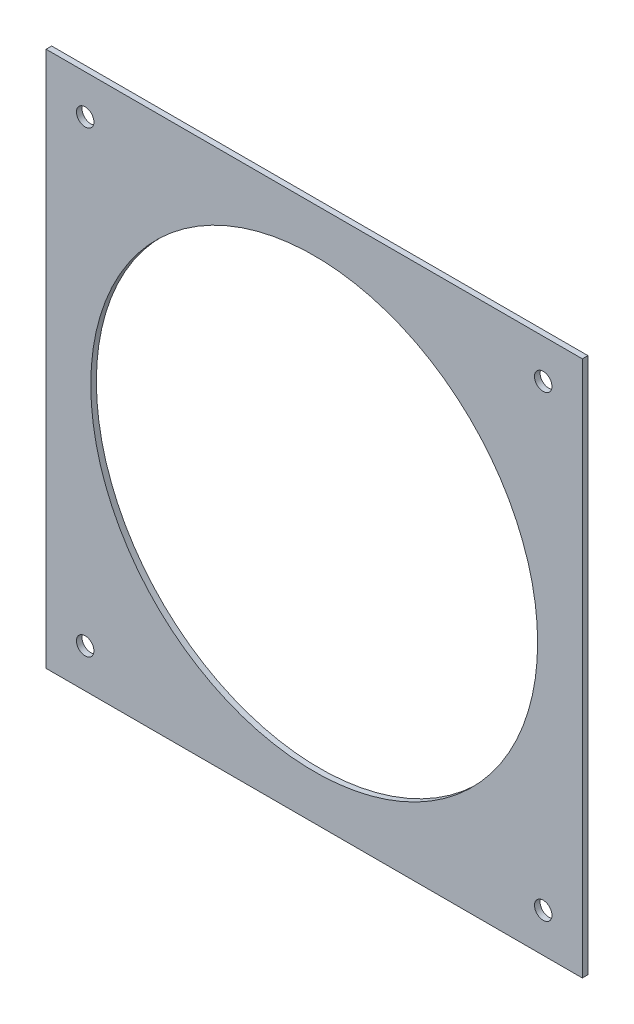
ISO-10303-21;
HEADER;
FILE_DESCRIPTION(('STEP AP214'),'2;1');
FILE_NAME('part.step','',(''),(''),'','','');
FILE_SCHEMA(('AUTOMOTIVE_DESIGN { 1 0 10303 214 1 1 1 1 }'));
ENDSEC;
DATA;
#1=APPLICATION_CONTEXT('core data for automotive mechanical design processes');
#2=APPLICATION_PROTOCOL_DEFINITION('international standard','automotive_design',2000,#1);
#3=PRODUCT_CONTEXT('',#1,'mechanical');
#4=PRODUCT('Part','Part','',(#3));
#5=PRODUCT_RELATED_PRODUCT_CATEGORY('part','',(#4));
#6=PRODUCT_DEFINITION_FORMATION('','',#4);
#7=PRODUCT_DEFINITION_CONTEXT('part definition',#1,'design');
#8=PRODUCT_DEFINITION('design','',#6,#7);
#9=PRODUCT_DEFINITION_SHAPE('','',#8);
#10=(LENGTH_UNIT() NAMED_UNIT(*) SI_UNIT(.MILLI.,.METRE.));
#11=(NAMED_UNIT(*) PLANE_ANGLE_UNIT() SI_UNIT($,.RADIAN.));
#12=(NAMED_UNIT(*) SI_UNIT($,.STERADIAN.) SOLID_ANGLE_UNIT());
#13=UNCERTAINTY_MEASURE_WITH_UNIT(LENGTH_MEASURE(1.E-05),#10,'distance_accuracy_value','');
#14=(GEOMETRIC_REPRESENTATION_CONTEXT(3) GLOBAL_UNCERTAINTY_ASSIGNED_CONTEXT((#13)) GLOBAL_UNIT_ASSIGNED_CONTEXT((#10,
#11,#12)) REPRESENTATION_CONTEXT('',''));
#15=CARTESIAN_POINT('',(0.,0.,0.));
#16=DIRECTION('',(0.,0.,1.));
#17=DIRECTION('',(1.,0.,0.));
#18=AXIS2_PLACEMENT_3D('',#15,#16,#17);
#19=CARTESIAN_POINT('',(0.,0.,0.));
#20=DIRECTION('',(0.,0.,-1.));
#21=DIRECTION('',(-1.,0.,0.));
#22=AXIS2_PLACEMENT_3D('',#19,#20,#21);
#23=PLANE('',#22);
#24=CARTESIAN_POINT('',(22.225,282.575,0.));
#25=DIRECTION('',(0.,0.,1.));
#26=DIRECTION('',(1.,0.,0.));
#27=AXIS2_PLACEMENT_3D('',#24,#25,#26);
#28=CIRCLE('',#27,4.961001);
#29=CARTESIAN_POINT('',(27.186001,282.575,0.));
#30=VERTEX_POINT('',#29);
#31=EDGE_CURVE('E160',#30,#30,#28,.T.);
#32=ORIENTED_EDGE('',*,*,#31,.T.);
#33=EDGE_LOOP('',(#32));
#34=FACE_BOUND('',#33,.T.);
#35=CARTESIAN_POINT('',(282.575,282.575,0.));
#36=DIRECTION('',(0.,0.,1.));
#37=DIRECTION('',(1.,0.,0.));
#38=AXIS2_PLACEMENT_3D('',#35,#36,#37);
#39=CIRCLE('',#38,4.96100100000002);
#40=CARTESIAN_POINT('',(287.536001,282.575,0.));
#41=VERTEX_POINT('',#40);
#42=EDGE_CURVE('E152',#41,#41,#39,.T.);
#43=ORIENTED_EDGE('',*,*,#42,.T.);
#44=EDGE_LOOP('',(#43));
#45=FACE_BOUND('',#44,.T.);
#46=CARTESIAN_POINT('',(282.575,22.225,0.));
#47=DIRECTION('',(0.,0.,1.));
#48=DIRECTION('',(1.,0.,0.));
#49=AXIS2_PLACEMENT_3D('',#46,#47,#48);
#50=CIRCLE('',#49,4.96100100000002);
#51=CARTESIAN_POINT('',(287.536001,22.225,0.));
#52=VERTEX_POINT('',#51);
#53=EDGE_CURVE('E144',#52,#52,#50,.T.);
#54=ORIENTED_EDGE('',*,*,#53,.T.);
#55=EDGE_LOOP('',(#54));
#56=FACE_BOUND('',#55,.T.);
#57=CARTESIAN_POINT('',(152.4,152.4,0.));
#58=DIRECTION('',(0.,0.,1.));
#59=DIRECTION('',(1.,0.,0.));
#60=AXIS2_PLACEMENT_3D('',#57,#58,#59);
#61=CIRCLE('',#60,127.);
#62=CARTESIAN_POINT('',(279.4,152.4,0.));
#63=VERTEX_POINT('',#62);
#64=EDGE_CURVE('E129',#63,#63,#61,.T.);
#65=ORIENTED_EDGE('',*,*,#64,.T.);
#66=EDGE_LOOP('',(#65));
#67=FACE_BOUND('',#66,.T.);
#68=DIRECTION('',(0.,-1.,0.));
#69=VECTOR('',#68,1.);
#70=CARTESIAN_POINT('',(0.,0.,0.));
#71=LINE('',#70,#69);
#72=CARTESIAN_POINT('',(0.,304.8,0.));
#73=VERTEX_POINT('',#72);
#74=CARTESIAN_POINT('',(0.,0.,0.));
#75=VERTEX_POINT('',#74);
#76=EDGE_CURVE('E108',#73,#75,#71,.T.);
#77=ORIENTED_EDGE('',*,*,#76,.F.);
#78=DIRECTION('',(-1.,0.,0.));
#79=VECTOR('',#78,1.);
#80=CARTESIAN_POINT('',(0.,304.8,0.));
#81=LINE('',#80,#79);
#82=CARTESIAN_POINT('',(304.8,304.8,0.));
#83=VERTEX_POINT('',#82);
#84=EDGE_CURVE('E79',#83,#73,#81,.T.);
#85=ORIENTED_EDGE('',*,*,#84,.F.);
#86=DIRECTION('',(0.,1.,0.));
#87=VECTOR('',#86,1.);
#88=CARTESIAN_POINT('',(304.8,0.,0.));
#89=LINE('',#88,#87);
#90=CARTESIAN_POINT('',(304.8,0.,0.));
#91=VERTEX_POINT('',#90);
#92=EDGE_CURVE('E73',#91,#83,#89,.T.);
#93=ORIENTED_EDGE('',*,*,#92,.F.);
#94=DIRECTION('',(1.,0.,0.));
#95=VECTOR('',#94,1.);
#96=CARTESIAN_POINT('',(0.,0.,0.));
#97=LINE('',#96,#95);
#98=EDGE_CURVE('E97',#75,#91,#97,.T.);
#99=ORIENTED_EDGE('',*,*,#98,.F.);
#100=EDGE_LOOP('',(#77,#85,#93,#99));
#101=FACE_BOUND('',#100,.T.);
#102=CARTESIAN_POINT('',(22.225,22.225,0.));
#103=DIRECTION('',(0.,0.,1.));
#104=DIRECTION('',(1.,0.,0.));
#105=AXIS2_PLACEMENT_3D('',#102,#103,#104);
#106=CIRCLE('',#105,4.961001);
#107=CARTESIAN_POINT('',(27.186001,22.225,0.));
#108=VERTEX_POINT('',#107);
#109=EDGE_CURVE('E133',#108,#108,#106,.T.);
#110=ORIENTED_EDGE('',*,*,#109,.T.);
#111=EDGE_LOOP('',(#110));
#112=FACE_BOUND('',#111,.T.);
#113=ADVANCED_FACE('F38',(#34,#45,#56,#67,#101,#112),#23,.T.);
#114=CARTESIAN_POINT('',(0.,0.,3.175));
#115=DIRECTION('',(0.,0.,-1.));
#116=DIRECTION('',(-1.,0.,0.));
#117=AXIS2_PLACEMENT_3D('',#114,#115,#116);
#118=PLANE('',#117);
#119=CARTESIAN_POINT('',(22.225,282.575,3.175));
#120=DIRECTION('',(0.,0.,1.));
#121=DIRECTION('',(1.,0.,0.));
#122=AXIS2_PLACEMENT_3D('',#119,#120,#121);
#123=CIRCLE('',#122,4.96100099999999);
#124=CARTESIAN_POINT('',(27.186001,282.575,3.175));
#125=VERTEX_POINT('',#124);
#126=EDGE_CURVE('E164',#125,#125,#123,.T.);
#127=ORIENTED_EDGE('',*,*,#126,.F.);
#128=EDGE_LOOP('',(#127));
#129=FACE_BOUND('',#128,.T.);
#130=CARTESIAN_POINT('',(282.575,282.575,3.175));
#131=DIRECTION('',(0.,0.,1.));
#132=DIRECTION('',(1.,0.,0.));
#133=AXIS2_PLACEMENT_3D('',#130,#131,#132);
#134=CIRCLE('',#133,4.96100099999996);
#135=CARTESIAN_POINT('',(287.536001,282.575,3.175));
#136=VERTEX_POINT('',#135);
#137=EDGE_CURVE('E156',#136,#136,#134,.T.);
#138=ORIENTED_EDGE('',*,*,#137,.F.);
#139=EDGE_LOOP('',(#138));
#140=FACE_BOUND('',#139,.T.);
#141=CARTESIAN_POINT('',(282.575,22.225,3.175));
#142=DIRECTION('',(0.,0.,1.));
#143=DIRECTION('',(1.,0.,0.));
#144=AXIS2_PLACEMENT_3D('',#141,#142,#143);
#145=CIRCLE('',#144,4.96100099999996);
#146=CARTESIAN_POINT('',(287.536001,22.225,3.175));
#147=VERTEX_POINT('',#146);
#148=EDGE_CURVE('E148',#147,#147,#145,.T.);
#149=ORIENTED_EDGE('',*,*,#148,.F.);
#150=EDGE_LOOP('',(#149));
#151=FACE_BOUND('',#150,.T.);
#152=CARTESIAN_POINT('',(22.225,22.225,3.175));
#153=DIRECTION('',(0.,0.,1.));
#154=DIRECTION('',(1.,0.,0.));
#155=AXIS2_PLACEMENT_3D('',#152,#153,#154);
#156=CIRCLE('',#155,4.96100099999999);
#157=CARTESIAN_POINT('',(27.186001,22.225,3.175));
#158=VERTEX_POINT('',#157);
#159=EDGE_CURVE('E140',#158,#158,#156,.T.);
#160=ORIENTED_EDGE('',*,*,#159,.F.);
#161=EDGE_LOOP('',(#160));
#162=FACE_BOUND('',#161,.T.);
#163=DIRECTION('',(0.,-1.,0.));
#164=VECTOR('',#163,1.);
#165=CARTESIAN_POINT('',(0.,0.,3.175));
#166=LINE('',#165,#164);
#167=CARTESIAN_POINT('',(0.,304.8,3.175));
#168=VERTEX_POINT('',#167);
#169=CARTESIAN_POINT('',(0.,0.,3.175));
#170=VERTEX_POINT('',#169);
#171=EDGE_CURVE('E92',#168,#170,#166,.T.);
#172=ORIENTED_EDGE('',*,*,#171,.T.);
#173=DIRECTION('',(1.,0.,0.));
#174=VECTOR('',#173,1.);
#175=CARTESIAN_POINT('',(0.,0.,3.175));
#176=LINE('',#175,#174);
#177=CARTESIAN_POINT('',(304.8,0.,3.175));
#178=VERTEX_POINT('',#177);
#179=EDGE_CURVE('E86',#170,#178,#176,.T.);
#180=ORIENTED_EDGE('',*,*,#179,.T.);
#181=DIRECTION('',(0.,1.,0.));
#182=VECTOR('',#181,1.);
#183=CARTESIAN_POINT('',(304.8,0.,3.175));
#184=LINE('',#183,#182);
#185=CARTESIAN_POINT('',(304.8,304.8,3.175));
#186=VERTEX_POINT('',#185);
#187=EDGE_CURVE('E90',#178,#186,#184,.T.);
#188=ORIENTED_EDGE('',*,*,#187,.T.);
#189=DIRECTION('',(-1.,0.,0.));
#190=VECTOR('',#189,1.);
#191=CARTESIAN_POINT('',(0.,304.8,3.175));
#192=LINE('',#191,#190);
#193=EDGE_CURVE('E56',#186,#168,#192,.T.);
#194=ORIENTED_EDGE('',*,*,#193,.T.);
#195=EDGE_LOOP('',(#172,#180,#188,#194));
#196=FACE_BOUND('',#195,.T.);
#197=CARTESIAN_POINT('',(152.4,152.4,3.175));
#198=DIRECTION('',(0.,0.,1.));
#199=DIRECTION('',(1.,0.,0.));
#200=AXIS2_PLACEMENT_3D('',#197,#198,#199);
#201=CIRCLE('',#200,127.);
#202=CARTESIAN_POINT('',(279.4,152.4,3.175));
#203=VERTEX_POINT('',#202);
#204=EDGE_CURVE('E112',#203,#203,#201,.T.);
#205=ORIENTED_EDGE('',*,*,#204,.F.);
#206=EDGE_LOOP('',(#205));
#207=FACE_BOUND('',#206,.T.);
#208=ADVANCED_FACE('F87',(#129,#140,#151,#162,#196,#207),#118,.F.);
#209=CARTESIAN_POINT('',(0.,0.,3.175));
#210=DIRECTION('',(1.,0.,0.));
#211=DIRECTION('',(0.,0.,-1.));
#212=AXIS2_PLACEMENT_3D('',#209,#210,#211);
#213=PLANE('',#212);
#214=ORIENTED_EDGE('',*,*,#76,.T.);
#215=DIRECTION('',(0.,0.,-1.));
#216=VECTOR('',#215,1.);
#217=CARTESIAN_POINT('',(0.,0.,3.175));
#218=LINE('',#217,#216);
#219=EDGE_CURVE('E11',#170,#75,#218,.T.);
#220=ORIENTED_EDGE('',*,*,#219,.F.);
#221=ORIENTED_EDGE('',*,*,#171,.F.);
#222=DIRECTION('',(0.,0.,-1.));
#223=VECTOR('',#222,1.);
#224=CARTESIAN_POINT('',(0.,304.8,3.175));
#225=LINE('',#224,#223);
#226=EDGE_CURVE('E104',#168,#73,#225,.T.);
#227=ORIENTED_EDGE('',*,*,#226,.T.);
#228=EDGE_LOOP('',(#214,#220,#221,#227));
#229=FACE_BOUND('',#228,.T.);
#230=ADVANCED_FACE('F40',(#229),#213,.F.);
#231=CARTESIAN_POINT('',(0.,0.,3.175));
#232=DIRECTION('',(0.,1.,0.));
#233=DIRECTION('',(0.,0.,1.));
#234=AXIS2_PLACEMENT_3D('',#231,#232,#233);
#235=PLANE('',#234);
#236=ORIENTED_EDGE('',*,*,#98,.T.);
#237=DIRECTION('',(0.,0.,-1.));
#238=VECTOR('',#237,1.);
#239=CARTESIAN_POINT('',(304.8,0.,3.175));
#240=LINE('',#239,#238);
#241=EDGE_CURVE('E48',#178,#91,#240,.T.);
#242=ORIENTED_EDGE('',*,*,#241,.F.);
#243=ORIENTED_EDGE('',*,*,#179,.F.);
#244=ORIENTED_EDGE('',*,*,#219,.T.);
#245=EDGE_LOOP('',(#236,#242,#243,#244));
#246=FACE_BOUND('',#245,.T.);
#247=ADVANCED_FACE('F96',(#246),#235,.F.);
#248=CARTESIAN_POINT('',(304.8,0.,3.175));
#249=DIRECTION('',(-1.,0.,0.));
#250=DIRECTION('',(0.,0.,1.));
#251=AXIS2_PLACEMENT_3D('',#248,#249,#250);
#252=PLANE('',#251);
#253=ORIENTED_EDGE('',*,*,#92,.T.);
#254=DIRECTION('',(0.,0.,-1.));
#255=VECTOR('',#254,1.);
#256=CARTESIAN_POINT('',(304.8,304.8,3.175));
#257=LINE('',#256,#255);
#258=EDGE_CURVE('E99',#186,#83,#257,.T.);
#259=ORIENTED_EDGE('',*,*,#258,.F.);
#260=ORIENTED_EDGE('',*,*,#187,.F.);
#261=ORIENTED_EDGE('',*,*,#241,.T.);
#262=EDGE_LOOP('',(#253,#259,#260,#261));
#263=FACE_BOUND('',#262,.T.);
#264=ADVANCED_FACE('F100',(#263),#252,.F.);
#265=CARTESIAN_POINT('',(0.,304.8,3.175));
#266=DIRECTION('',(0.,-1.,0.));
#267=DIRECTION('',(0.,0.,-1.));
#268=AXIS2_PLACEMENT_3D('',#265,#266,#267);
#269=PLANE('',#268);
#270=ORIENTED_EDGE('',*,*,#84,.T.);
#271=ORIENTED_EDGE('',*,*,#226,.F.);
#272=ORIENTED_EDGE('',*,*,#193,.F.);
#273=ORIENTED_EDGE('',*,*,#258,.T.);
#274=EDGE_LOOP('',(#270,#271,#272,#273));
#275=FACE_BOUND('',#274,.T.);
#276=ADVANCED_FACE('F122',(#275),#269,.F.);
#277=CARTESIAN_POINT('',(152.4,152.4,3.175));
#278=DIRECTION('',(0.,0.,-1.));
#279=DIRECTION('',(-1.,0.,0.));
#280=AXIS2_PLACEMENT_3D('',#277,#278,#279);
#281=CYLINDRICAL_SURFACE('',#280,127.);
#282=ORIENTED_EDGE('',*,*,#204,.T.);
#283=EDGE_LOOP('',(#282));
#284=FACE_BOUND('',#283,.T.);
#285=ORIENTED_EDGE('',*,*,#64,.F.);
#286=EDGE_LOOP('',(#285));
#287=FACE_BOUND('',#286,.T.);
#288=ADVANCED_FACE('F183',(#284,#287),#281,.F.);
#289=CARTESIAN_POINT('',(22.225,22.225,3.175));
#290=DIRECTION('',(0.,0.,1.));
#291=DIRECTION('',(1.,0.,0.));
#292=AXIS2_PLACEMENT_3D('',#289,#290,#291);
#293=CYLINDRICAL_SURFACE('',#292,4.96100099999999);
#294=ORIENTED_EDGE('',*,*,#109,.F.);
#295=EDGE_LOOP('',(#294));
#296=FACE_BOUND('',#295,.T.);
#297=ORIENTED_EDGE('',*,*,#159,.T.);
#298=EDGE_LOOP('',(#297));
#299=FACE_BOUND('',#298,.T.);
#300=ADVANCED_FACE('F180',(#296,#299),#293,.F.);
#301=CARTESIAN_POINT('',(282.575,22.225,3.175));
#302=DIRECTION('',(0.,0.,1.));
#303=DIRECTION('',(1.,0.,0.));
#304=AXIS2_PLACEMENT_3D('',#301,#302,#303);
#305=CYLINDRICAL_SURFACE('',#304,4.96100099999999);
#306=ORIENTED_EDGE('',*,*,#53,.F.);
#307=EDGE_LOOP('',(#306));
#308=FACE_BOUND('',#307,.T.);
#309=ORIENTED_EDGE('',*,*,#148,.T.);
#310=EDGE_LOOP('',(#309));
#311=FACE_BOUND('',#310,.T.);
#312=ADVANCED_FACE('F182',(#308,#311),#305,.F.);
#313=CARTESIAN_POINT('',(282.575,282.575,3.175));
#314=DIRECTION('',(0.,0.,1.));
#315=DIRECTION('',(1.,0.,0.));
#316=AXIS2_PLACEMENT_3D('',#313,#314,#315);
#317=CYLINDRICAL_SURFACE('',#316,4.96100099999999);
#318=ORIENTED_EDGE('',*,*,#42,.F.);
#319=EDGE_LOOP('',(#318));
#320=FACE_BOUND('',#319,.T.);
#321=ORIENTED_EDGE('',*,*,#137,.T.);
#322=EDGE_LOOP('',(#321));
#323=FACE_BOUND('',#322,.T.);
#324=ADVANCED_FACE('F190',(#320,#323),#317,.F.);
#325=CARTESIAN_POINT('',(22.225,282.575,3.175));
#326=DIRECTION('',(0.,0.,1.));
#327=DIRECTION('',(1.,0.,0.));
#328=AXIS2_PLACEMENT_3D('',#325,#326,#327);
#329=CYLINDRICAL_SURFACE('',#328,4.96100099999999);
#330=ORIENTED_EDGE('',*,*,#31,.F.);
#331=EDGE_LOOP('',(#330));
#332=FACE_BOUND('',#331,.T.);
#333=ORIENTED_EDGE('',*,*,#126,.T.);
#334=EDGE_LOOP('',(#333));
#335=FACE_BOUND('',#334,.T.);
#336=ADVANCED_FACE('F169',(#332,#335),#329,.F.);
#337=CLOSED_SHELL('',(#113,#208,#230,#247,#264,#276,#288,#300,#312,#324,#336));
#338=MANIFOLD_SOLID_BREP('B2',#337);
#339=ADVANCED_BREP_SHAPE_REPRESENTATION('',(#18,#338),#14);
#340=SHAPE_DEFINITION_REPRESENTATION(#9,#339);
ENDSEC;
END-ISO-10303-21;
